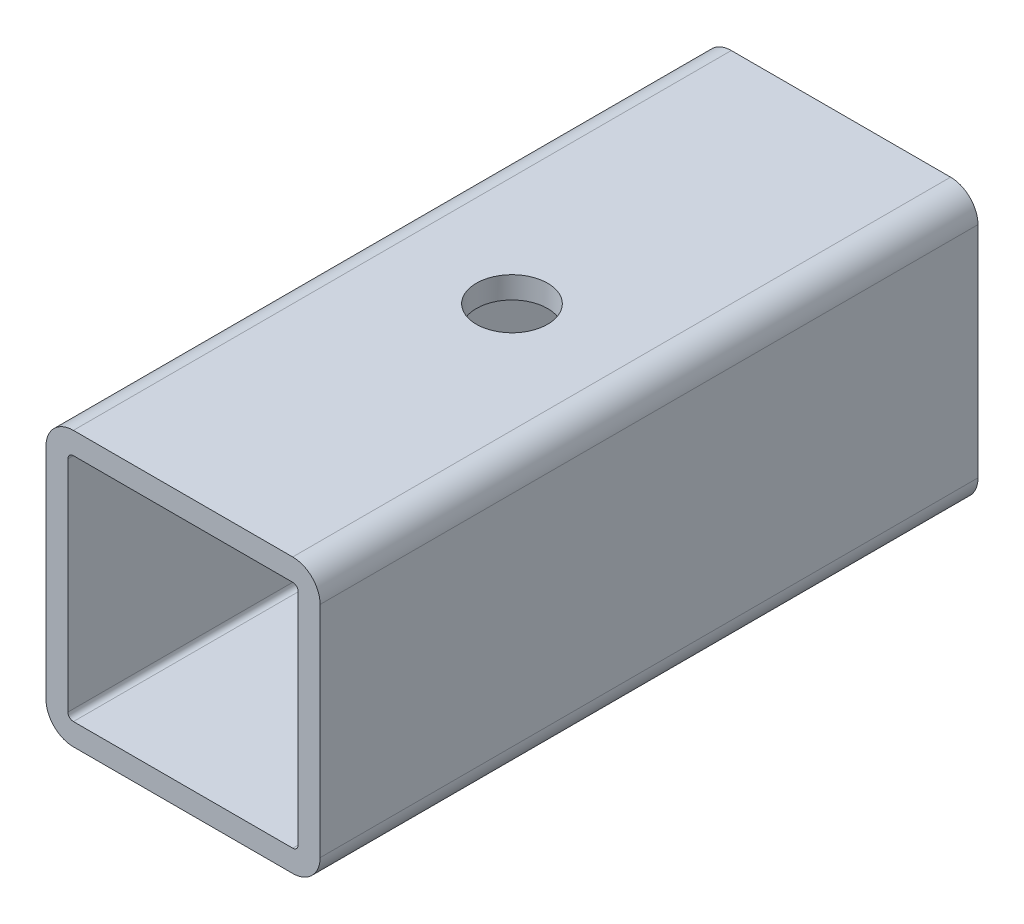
from build123d import *

# Parameters (mm, degrees)
BASE_EXTRUSION_DEPTH    = 120
ESQUISSE2_R             = 6.5
ENL_V_MAT_EXTRU_1_DEPTH = 140.283882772


with BuildPart() as part:
    # Esquisse1 → Base-Extrusion (new body)
    with BuildSketch(Plane.XY):
        with BuildLine():
            Line((5, 0), (45, 0))
            ThreePointArc((45, 0), (48.535533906, -1.464466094), (50, -5))
            Line((50, -5), (50, -45))
            ThreePointArc((50, -45), (48.535533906, -48.535533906), (45, -50))
            Line((45, -50), (5, -50))
            ThreePointArc((5, -50), (1.464466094, -48.535533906), (0, -45))
            Line((0, -45), (0, -5))
            ThreePointArc((0, -5), (1.464466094, -1.464466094), (5, 0))
        make_face()
        with BuildLine():
            Line((5, -4), (45, -4))
            ThreePointArc((45, -4), (45.707106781, -4.292893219), (46, -5))
            Line((46, -5), (46, -45))
            ThreePointArc((46, -45), (45.707106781, -45.707106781), (45, -46))
            Line((45, -46), (5, -46))
            ThreePointArc((5, -46), (4.292893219, -45.707106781), (4, -45))
            Line((4, -45), (4, -5))
            ThreePointArc((4, -5), (4.292893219, -4.292893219), (5, -4))
        make_face(mode=Mode.SUBTRACT)
    extrude(amount=BASE_EXTRUSION_DEPTH)

    # Esquisse2 → Enl_v. mat.-Extru.1 (cut, through all)
    with BuildSketch(Plane(origin=(0, 0, 0), x_dir=(-1, 0, 0), z_dir=(0, 1, 0))):
        with Locations(Location((-25, 60, 0), (0, 0, 90))):
            Circle(ESQUISSE2_R)
    extrude(amount=-ENL_V_MAT_EXTRU_1_DEPTH, mode=Mode.SUBTRACT)


solid = part.part
